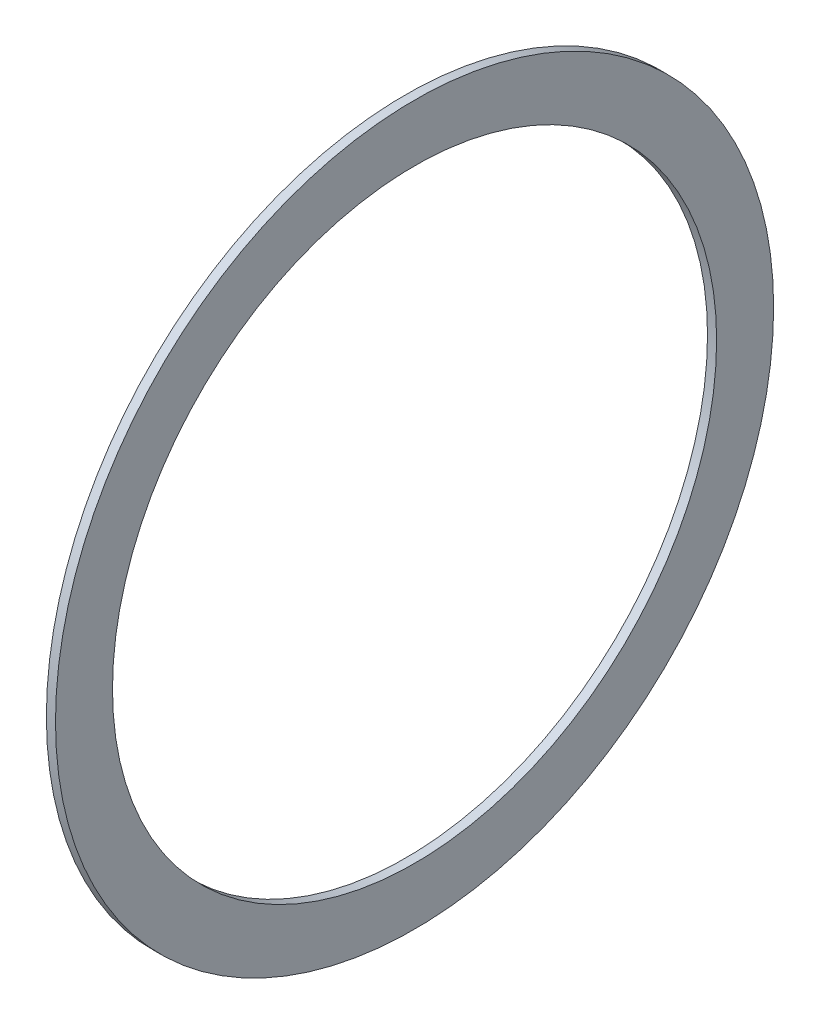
ISO-10303-21;
HEADER;
FILE_DESCRIPTION(('STEP AP214'),'2;1');
FILE_NAME('part.step','',(''),(''),'','','');
FILE_SCHEMA(('AUTOMOTIVE_DESIGN { 1 0 10303 214 1 1 1 1 }'));
ENDSEC;
DATA;
#1=APPLICATION_CONTEXT('core data for automotive mechanical design processes');
#2=APPLICATION_PROTOCOL_DEFINITION('international standard','automotive_design',2000,#1);
#3=PRODUCT_CONTEXT('',#1,'mechanical');
#4=PRODUCT('Part','Part','',(#3));
#5=PRODUCT_RELATED_PRODUCT_CATEGORY('part','',(#4));
#6=PRODUCT_DEFINITION_FORMATION('','',#4);
#7=PRODUCT_DEFINITION_CONTEXT('part definition',#1,'design');
#8=PRODUCT_DEFINITION('design','',#6,#7);
#9=PRODUCT_DEFINITION_SHAPE('','',#8);
#10=(LENGTH_UNIT() NAMED_UNIT(*) SI_UNIT(.MILLI.,.METRE.));
#11=(NAMED_UNIT(*) PLANE_ANGLE_UNIT() SI_UNIT($,.RADIAN.));
#12=(NAMED_UNIT(*) SI_UNIT($,.STERADIAN.) SOLID_ANGLE_UNIT());
#13=UNCERTAINTY_MEASURE_WITH_UNIT(LENGTH_MEASURE(1.E-05),#10,'distance_accuracy_value','');
#14=(GEOMETRIC_REPRESENTATION_CONTEXT(3) GLOBAL_UNCERTAINTY_ASSIGNED_CONTEXT((#13)) GLOBAL_UNIT_ASSIGNED_CONTEXT((#10,
#11,#12)) REPRESENTATION_CONTEXT('',''));
#15=CARTESIAN_POINT('',(0.,0.,0.));
#16=DIRECTION('',(0.,0.,1.));
#17=DIRECTION('',(1.,0.,0.));
#18=AXIS2_PLACEMENT_3D('',#15,#16,#17);
#19=CARTESIAN_POINT('',(-4.5,0.,0.));
#20=DIRECTION('',(-1.,0.,0.));
#21=DIRECTION('',(0.,0.,1.));
#22=AXIS2_PLACEMENT_3D('',#19,#20,#21);
#23=PLANE('',#22);
#24=CARTESIAN_POINT('',(-4.5,0.,0.));
#25=DIRECTION('',(1.,0.,0.));
#26=DIRECTION('',(0.,0.,-1.));
#27=AXIS2_PLACEMENT_3D('',#24,#25,#26);
#28=CIRCLE('',#27,6.625);
#29=CARTESIAN_POINT('',(-4.5,0.,-6.625));
#30=VERTEX_POINT('',#29);
#31=EDGE_CURVE('E27',#30,#30,#28,.F.);
#32=ORIENTED_EDGE('',*,*,#31,.T.);
#33=EDGE_LOOP('',(#32));
#34=FACE_BOUND('',#33,.T.);
#35=CARTESIAN_POINT('',(-4.5,0.,0.));
#36=DIRECTION('',(1.,0.,0.));
#37=DIRECTION('',(0.,0.,-1.));
#38=AXIS2_PLACEMENT_3D('',#35,#36,#37);
#39=CIRCLE('',#38,7.875);
#40=CARTESIAN_POINT('',(-4.5,0.,-7.875));
#41=VERTEX_POINT('',#40);
#42=EDGE_CURVE('E18',#41,#41,#39,.F.);
#43=ORIENTED_EDGE('',*,*,#42,.F.);
#44=EDGE_LOOP('',(#43));
#45=FACE_BOUND('',#44,.T.);
#46=ADVANCED_FACE('F15',(#34,#45),#23,.F.);
#47=CARTESIAN_POINT('',(-4.7,0.,0.));
#48=DIRECTION('',(1.,0.,0.));
#49=DIRECTION('',(0.,0.,-1.));
#50=AXIS2_PLACEMENT_3D('',#47,#48,#49);
#51=CYLINDRICAL_SURFACE('',#50,7.875);
#52=ORIENTED_EDGE('',*,*,#42,.T.);
#53=EDGE_LOOP('',(#52));
#54=FACE_BOUND('',#53,.T.);
#55=CARTESIAN_POINT('',(-4.7,0.,0.));
#56=DIRECTION('',(1.,0.,0.));
#57=DIRECTION('',(0.,0.,-1.));
#58=AXIS2_PLACEMENT_3D('',#55,#56,#57);
#59=CIRCLE('',#58,7.875);
#60=CARTESIAN_POINT('',(-4.7,0.,-7.875));
#61=VERTEX_POINT('',#60);
#62=EDGE_CURVE('E22',#61,#61,#59,.F.);
#63=ORIENTED_EDGE('',*,*,#62,.F.);
#64=EDGE_LOOP('',(#63));
#65=FACE_BOUND('',#64,.T.);
#66=ADVANCED_FACE('F35',(#54,#65),#51,.T.);
#67=CARTESIAN_POINT('',(-4.7,0.,0.));
#68=DIRECTION('',(1.,0.,0.));
#69=DIRECTION('',(0.,0.,-1.));
#70=AXIS2_PLACEMENT_3D('',#67,#68,#69);
#71=CYLINDRICAL_SURFACE('',#70,6.625);
#72=CARTESIAN_POINT('',(-4.7,0.,0.));
#73=DIRECTION('',(1.,0.,0.));
#74=DIRECTION('',(0.,0.,-1.));
#75=AXIS2_PLACEMENT_3D('',#72,#73,#74);
#76=CIRCLE('',#75,6.625);
#77=CARTESIAN_POINT('',(-4.7,0.,-6.625));
#78=VERTEX_POINT('',#77);
#79=EDGE_CURVE('E10',#78,#78,#76,.T.);
#80=ORIENTED_EDGE('',*,*,#79,.F.);
#81=EDGE_LOOP('',(#80));
#82=FACE_BOUND('',#81,.T.);
#83=ORIENTED_EDGE('',*,*,#31,.F.);
#84=EDGE_LOOP('',(#83));
#85=FACE_BOUND('',#84,.T.);
#86=ADVANCED_FACE('F43',(#82,#85),#71,.F.);
#87=CARTESIAN_POINT('',(-4.7,0.,0.));
#88=DIRECTION('',(-1.,0.,0.));
#89=DIRECTION('',(0.,0.,1.));
#90=AXIS2_PLACEMENT_3D('',#87,#88,#89);
#91=PLANE('',#90);
#92=ORIENTED_EDGE('',*,*,#79,.T.);
#93=EDGE_LOOP('',(#92));
#94=FACE_BOUND('',#93,.T.);
#95=ORIENTED_EDGE('',*,*,#62,.T.);
#96=EDGE_LOOP('',(#95));
#97=FACE_BOUND('',#96,.T.);
#98=ADVANCED_FACE('F44',(#94,#97),#91,.T.);
#99=CLOSED_SHELL('',(#46,#66,#86,#98));
#100=MANIFOLD_SOLID_BREP('B1',#99);
#101=ADVANCED_BREP_SHAPE_REPRESENTATION('',(#18,#100),#14);
#102=SHAPE_DEFINITION_REPRESENTATION(#9,#101);
ENDSEC;
END-ISO-10303-21;
